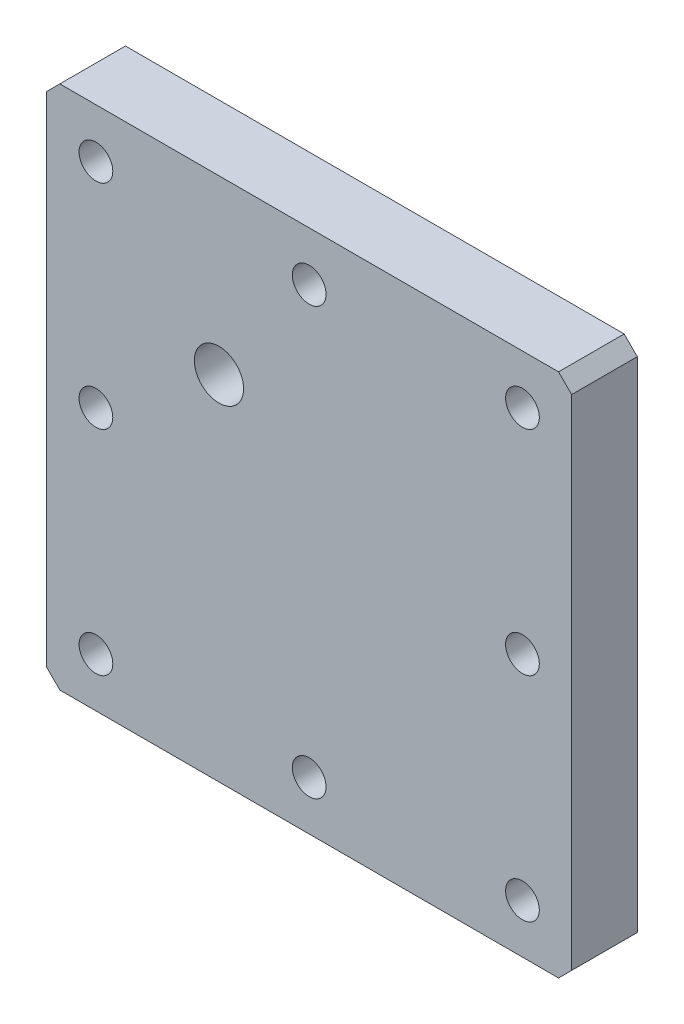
from build123d import *

# Parameters (mm, degrees)
SKETCH1_R           = 3.2639
SKETCH1_R_2         = 4.7625
BOSS_EXTRUDE1_DEPTH = 12.7


with BuildPart() as part:
    # Sketch1 → Boss-Extrude1 (new body)
    with BuildSketch(Plane.XY):
        Polygon((-50.8, 48.26), (-48.26, 50.8), (48.26, 50.8), (50.8, 48.26), (50.8, -48.26), (48.26, -50.8), (-48.26, -50.8), (-50.8, -48.26), align=None)
        with Locations((-41.275, 41.275)):
            Circle(SKETCH1_R, mode=Mode.SUBTRACT)
        with Locations((0, 41.275)):
            Circle(SKETCH1_R, mode=Mode.SUBTRACT)
        with Locations((41.275, 41.275)):
            Circle(SKETCH1_R, mode=Mode.SUBTRACT)
        with Locations((41.275, 0)):
            Circle(SKETCH1_R, mode=Mode.SUBTRACT)
        with Locations((41.275, -41.275)):
            Circle(SKETCH1_R, mode=Mode.SUBTRACT)
        with Locations((0, -41.275)):
            Circle(SKETCH1_R, mode=Mode.SUBTRACT)
        with Locations((-41.275, -41.275)):
            Circle(SKETCH1_R, mode=Mode.SUBTRACT)
        with Locations((-41.275, 0)):
            Circle(SKETCH1_R, mode=Mode.SUBTRACT)
        with Locations((-17.4625, 17.4625)):
            Circle(SKETCH1_R_2, mode=Mode.SUBTRACT)
    extrude(amount=BOSS_EXTRUDE1_DEPTH)


solid = part.part
